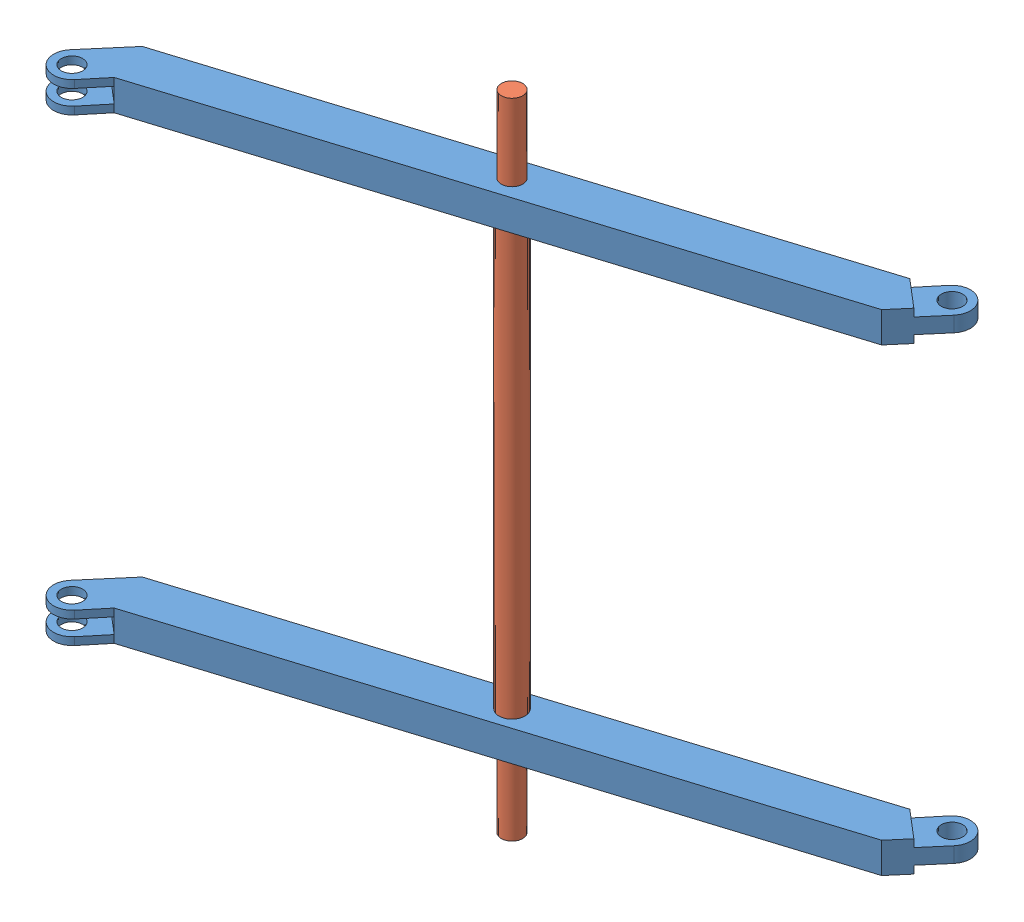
SolidWorks assembly layer_2.SLDASM, configuration Default (file format 11000). Lengths in mm.
Overall size (2311.11 2100 945.79).
3 component instances, 2 part files, 0 mates.
Components (placement in the parent):
- crossarm-1: crossarm.SLDPRT [Default] at (151.3438 750 584.7352) x (0 1 0) z (0.954527 0 -0.298125) size (100 260 2340)
- crossarm-2: crossarm.SLDPRT [Default] at (151.3438 -750 584.7352) x (0 1 0) z (0.954527 0 -0.298125) size (100 260 2340)
- cross_rod-1: cross_rod.SLDPRT [Default] at (151.3438 0 584.7352) x (-0.66325 0 -0.748398) z (0 1 0) size (85 85 2100)
